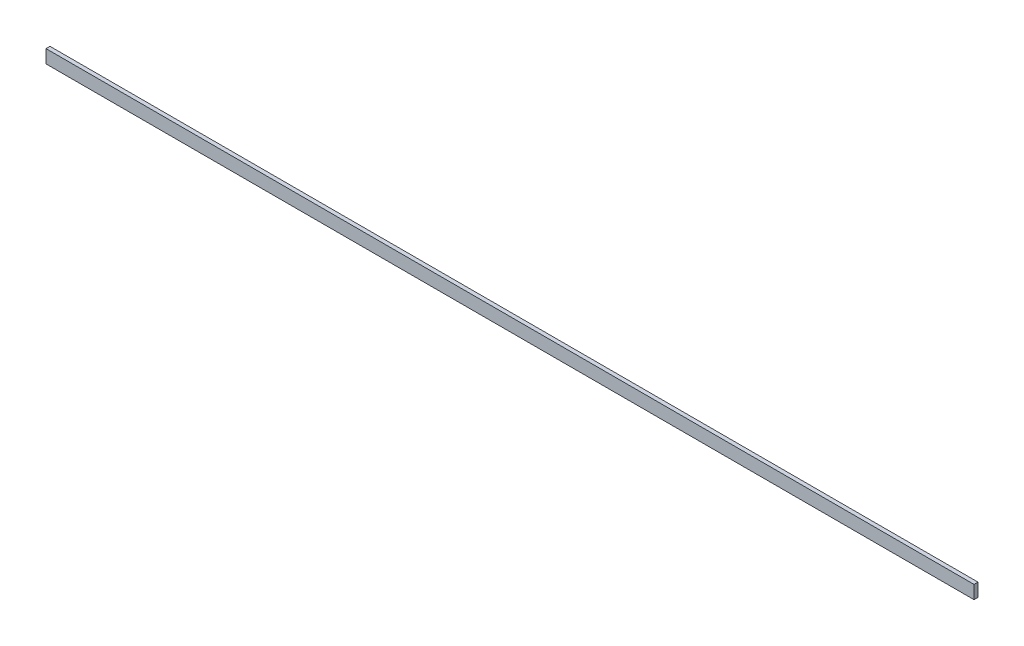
from build123d import *

# Parameters (mm, degrees)
SKIZZE1_W                       = 700
SKIZZE1_H                       = 10
AUFSATZ_LINEAR_AUSTRAGEN1_DEPTH = 3


with BuildPart() as part:
    # Skizze1 → Aufsatz-Linear austragen1 (new body)
    with BuildSketch(Plane.XY):
        Rectangle(SKIZZE1_W, SKIZZE1_H)
    extrude(amount=AUFSATZ_LINEAR_AUSTRAGEN1_DEPTH)


solid = part.part
